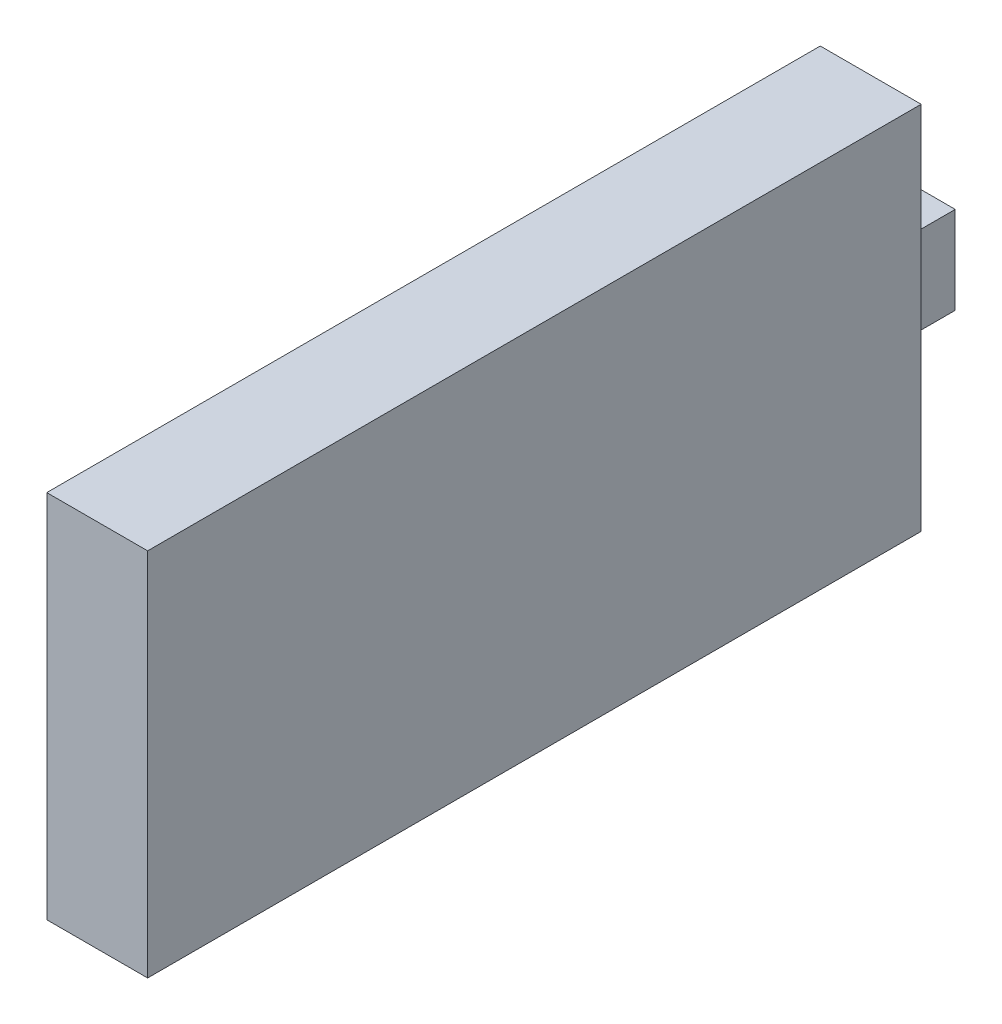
from build123d import *

# Parameters (mm, degrees)
SKIZZE2_W                       = 15
SKIZZE2_H                       = 115
AUFSATZ_LINEAR_AUSTRAGEN1_DEPTH = 55
SKIZZE3_W                       = 9
SKIZZE3_H                       = 13
AUFSATZ_LINEAR_AUSTRAGEN2_DEPTH = 10


with BuildPart() as part:
    # Skizze2 → Aufsatz-Linear austragen1 (new body)
    with BuildSketch(Plane(origin=(0, 0, 0), x_dir=(1, 0, 0), z_dir=(0, 1, 0))):
        with Locations((-64.551558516, 0)):
            Rectangle(SKIZZE2_W, SKIZZE2_H)
    extrude(amount=AUFSATZ_LINEAR_AUSTRAGEN1_DEPTH)

    # Skizze3 → Aufsatz-Linear austragen2 (add)
    with BuildSketch(Plane(origin=(0, 0, -57.5), x_dir=(-1, 0, 0), z_dir=(0, 0, -1))):
        with Locations((66.48173098, 27.5)):
            Rectangle(SKIZZE3_W, SKIZZE3_H)
    extrude(amount=AUFSATZ_LINEAR_AUSTRAGEN2_DEPTH)


solid = part.part
